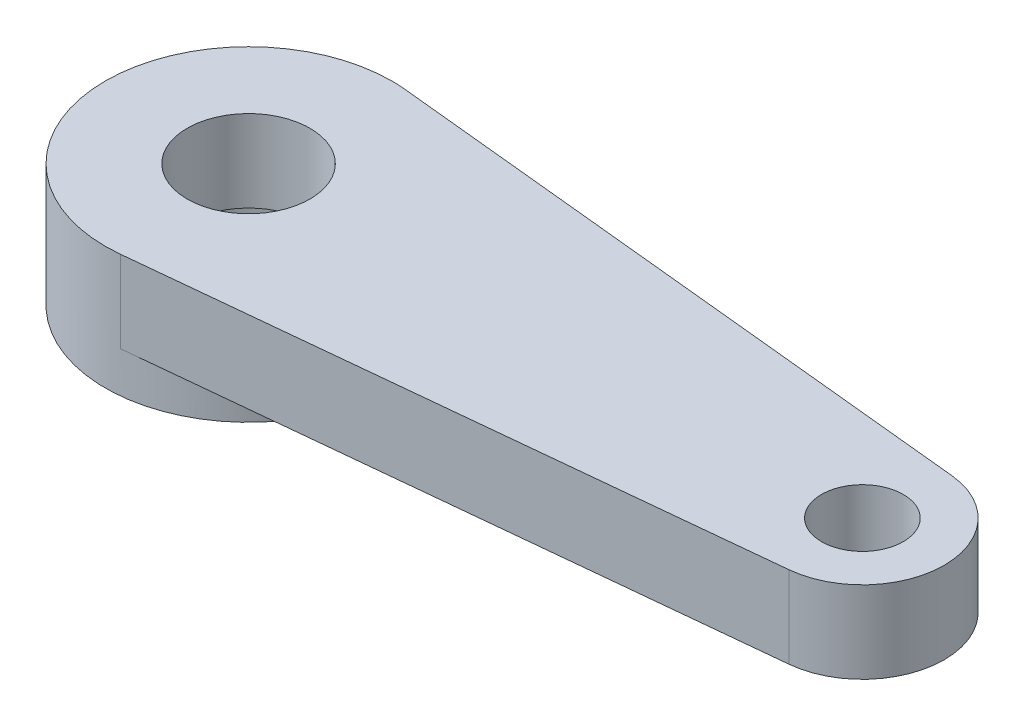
from build123d import *

# Parameters (mm, degrees)
SKETCH1_R           = 2
SKETCH1_R_2         = 1
SKETCH1_R_3         = 3.5
SKETCH1_R_4         = 1.5
BOSS_EXTRUDE1_DEPTH = 2
BOSS_EXTRUDE2_START = 1
SKETCH2_R           = 3.5
SKETCH2_R_2         = 2.5
BOSS_EXTRUDE2_DEPTH = 1


with BuildPart() as part:
    # Sketch1 → Boss-Extrude1 (new body)
    # profile 1 of 3: a face of its own
    with BuildSketch(Plane(origin=(0, 0, 0), x_dir=(1, 0, 0), z_dir=(0, 1, 0))):
        with BuildLine():
            Line((15.2, 1.989974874), (0.35, 3.48245603))
            ThreePointArc((0.35, 3.48245603), (2.59566947, 2.347871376), (3.5, 0))
            ThreePointArc((3.5, 0), (2.59566947, -2.347871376), (0.35, -3.48245603))
            Line((0.35, -3.48245603), (15.2, -1.989974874))
            ThreePointArc((15.2, -1.989974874), (13, 0), (15.2, 1.989974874))
        make_face()
    # profile 2 of 3: a face of its own
    with BuildSketch(Plane(origin=(0, 0, 0), x_dir=(1, 0, 0), z_dir=(0, 1, 0))):
        with Locations((15, 0)):
            Circle(SKETCH1_R)
        with Locations(Location((15, 0, 0), (0, 0, 270))):
            Circle(SKETCH1_R_2, mode=Mode.SUBTRACT)
    # profile 3 of 3: a face of its own
    with BuildSketch(Plane(origin=(0, 0, 0), x_dir=(1, 0, 0), z_dir=(0, 1, 0))):
        Circle(SKETCH1_R_3)
        with Locations(Location((0, 0, 0), (0, 0, 270))):
            Circle(SKETCH1_R_4, mode=Mode.SUBTRACT)
    extrude(amount=BOSS_EXTRUDE1_DEPTH)

    # Sketch2 → Boss-Extrude2 (add)
    with BuildSketch(Plane.XZ.offset(BOSS_EXTRUDE2_START)):
        with Locations(Location((0, 0, 0), (0, 0, 270))):
            Circle(SKETCH2_R)
        with Locations(Location((0, 0, 0), (0, 0, 270))):
            Circle(SKETCH2_R_2, mode=Mode.SUBTRACT)
    extrude(amount=-BOSS_EXTRUDE2_DEPTH)


solid = part.part
